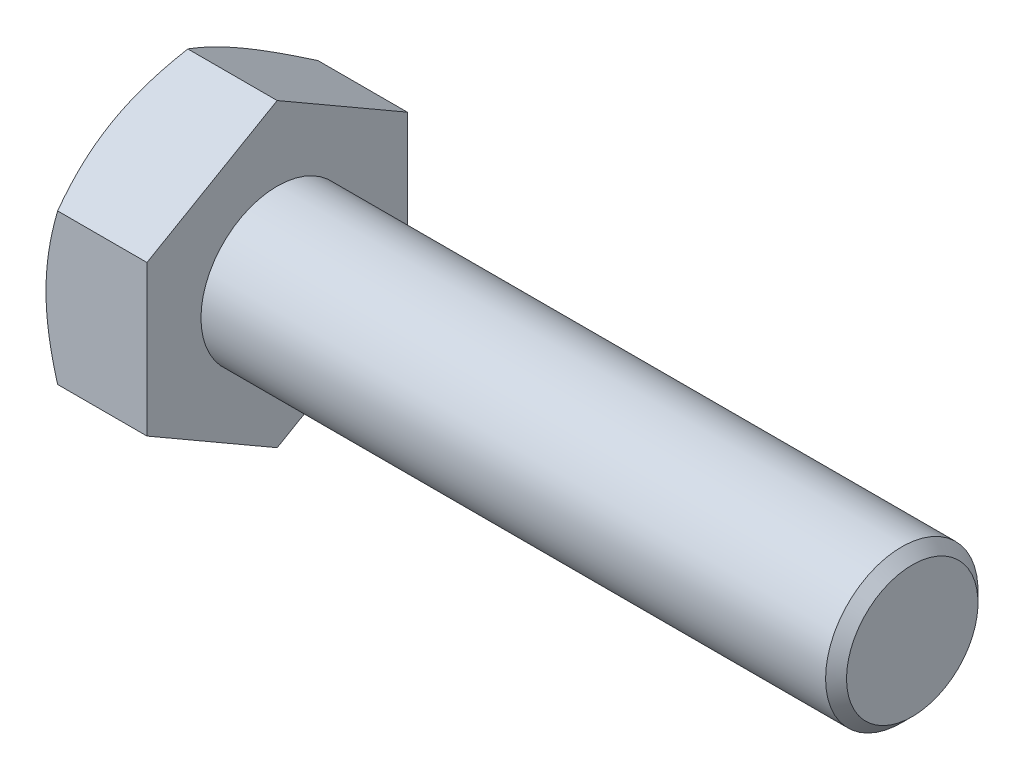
ISO-10303-21;
HEADER;
FILE_DESCRIPTION(('STEP AP214'),'2;1');
FILE_NAME('part.step','',(''),(''),'','','');
FILE_SCHEMA(('AUTOMOTIVE_DESIGN { 1 0 10303 214 1 1 1 1 }'));
ENDSEC;
DATA;
#1=APPLICATION_CONTEXT('core data for automotive mechanical design processes');
#2=APPLICATION_PROTOCOL_DEFINITION('international standard','automotive_design',2000,#1);
#3=PRODUCT_CONTEXT('',#1,'mechanical');
#4=PRODUCT('Part','Part','',(#3));
#5=PRODUCT_RELATED_PRODUCT_CATEGORY('part','',(#4));
#6=PRODUCT_DEFINITION_FORMATION('','',#4);
#7=PRODUCT_DEFINITION_CONTEXT('part definition',#1,'design');
#8=PRODUCT_DEFINITION('design','',#6,#7);
#9=PRODUCT_DEFINITION_SHAPE('','',#8);
#10=(LENGTH_UNIT() NAMED_UNIT(*) SI_UNIT(.MILLI.,.METRE.));
#11=(NAMED_UNIT(*) PLANE_ANGLE_UNIT() SI_UNIT($,.RADIAN.));
#12=(NAMED_UNIT(*) SI_UNIT($,.STERADIAN.) SOLID_ANGLE_UNIT());
#13=UNCERTAINTY_MEASURE_WITH_UNIT(LENGTH_MEASURE(1.E-05),#10,'distance_accuracy_value','');
#14=(GEOMETRIC_REPRESENTATION_CONTEXT(3) GLOBAL_UNCERTAINTY_ASSIGNED_CONTEXT((#13)) GLOBAL_UNIT_ASSIGNED_CONTEXT((#10,
#11,#12)) REPRESENTATION_CONTEXT('',''));
#15=CARTESIAN_POINT('',(0.,0.,0.));
#16=DIRECTION('',(0.,0.,1.));
#17=DIRECTION('',(1.,0.,0.));
#18=AXIS2_PLACEMENT_3D('',#15,#16,#17);
#19=CARTESIAN_POINT('',(15.9,11.8356805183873,-20.5));
#20=DIRECTION('',(0.,-0.866025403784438,0.500000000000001));
#21=DIRECTION('',(0.,-0.500000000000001,-0.866025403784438));
#22=AXIS2_PLACEMENT_3D('',#19,#20,#21);
#23=PLANE('',#22);
#24=CARTESIAN_POINT('',(1.83105281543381,23.6714765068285,0.000200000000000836));
#25=CARTESIAN_POINT('',(1.68086967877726,23.4113332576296,-0.45038132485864));
#26=CARTESIAN_POINT('',(1.53750164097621,23.1501753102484,-0.902720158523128));
#27=CARTESIAN_POINT('',(1.26629011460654,22.6257652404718,-1.81102504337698));
#28=CARTESIAN_POINT('',(1.13845173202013,22.3625124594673,-2.26699223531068));
#29=CARTESIAN_POINT('',(0.900017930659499,21.8334039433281,-3.1834350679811));
#30=CARTESIAN_POINT('',(0.789463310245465,21.5675435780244,-3.64391872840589));
#31=CARTESIAN_POINT('',(0.587971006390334,21.0339755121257,-4.56808572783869));
#32=CARTESIAN_POINT('',(0.497032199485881,20.7662679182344,-5.0317688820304));
#33=CARTESIAN_POINT('',(0.338639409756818,20.2358649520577,-5.95045376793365));
#34=CARTESIAN_POINT('',(0.270661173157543,19.9732089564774,-6.40538729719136));
#35=CARTESIAN_POINT('',(0.156677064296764,19.4466934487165,-7.3173389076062));
#36=CARTESIAN_POINT('',(0.110671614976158,19.1828339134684,-7.77435702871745));
#37=CARTESIAN_POINT('',(0.0417946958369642,18.6546716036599,-8.68916098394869));
#38=CARTESIAN_POINT('',(0.0188957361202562,18.3903697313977,-9.14694525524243));
#39=CARTESIAN_POINT('',(-0.0032757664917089,17.8615220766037,-10.0629362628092));
#40=CARTESIAN_POINT('',(-0.00254903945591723,17.5969763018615,-10.5211429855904));
#41=CARTESIAN_POINT('',(0.0208807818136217,17.1024027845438,-11.3777694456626));
#42=CARTESIAN_POINT('',(0.0407268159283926,16.8723398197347,-11.776250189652));
#43=CARTESIAN_POINT('',(0.0979103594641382,16.412763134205,-12.5722603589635));
#44=CARTESIAN_POINT('',(0.135247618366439,16.1832494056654,-12.9697897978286));
#45=CARTESIAN_POINT('',(0.226766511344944,15.7248559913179,-13.7637504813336));
#46=CARTESIAN_POINT('',(0.280963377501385,15.4959770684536,-14.1601804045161));
#47=CARTESIAN_POINT('',(0.40524228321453,15.0393151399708,-14.9511420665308));
#48=CARTESIAN_POINT('',(0.475324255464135,14.8115321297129,-15.3456738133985));
#49=CARTESIAN_POINT('',(0.711196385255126,14.120031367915,-16.5433882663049));
#50=CARTESIAN_POINT('',(0.900518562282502,13.658278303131,-17.3431680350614));
#51=CARTESIAN_POINT('',(1.22283076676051,12.9707481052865,-18.5340052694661));
#52=CARTESIAN_POINT('',(1.33654034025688,12.7426182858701,-18.9291377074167));
#53=CARTESIAN_POINT('',(1.57547119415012,12.2879365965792,-19.7166694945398));
#54=CARTESIAN_POINT('',(1.70068922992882,12.0613843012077,-20.1090695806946));
#55=CARTESIAN_POINT('',(1.83105281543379,11.8355650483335,-20.5002));
#56=B_SPLINE_CURVE_WITH_KNOTS('',3,(#24,#25,#26,#27,#28,#29,#30,#31,#32,#33,#34,#35,#36,#37,#38,
#39,#40,#41,#42,#43,#44,#45,#46,#47,#48,#49,#50,#51,#52,#53,#54,#55),.UNSPECIFIED.,.F.,.F.,(4,2,
2,2,2,2,2,2,2,2,2,2,2,2,2,4),(0.,1.62462772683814,3.24978817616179,4.87872871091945,
6.50757592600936,8.09621981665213,9.6848942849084,11.2716764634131,12.8584096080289,
14.2397371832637,15.6210449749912,17.0036043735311,18.3861579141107,21.2121645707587,
22.6227063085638,24.0328515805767),.UNSPECIFIED.);
#57=CARTESIAN_POINT('',(1.83098614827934,23.6713610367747,0.));
#58=VERTEX_POINT('',#57);
#59=CARTESIAN_POINT('',(0.,17.753520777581,-10.25));
#60=VERTEX_POINT('',#59);
#61=EDGE_CURVE('E49',#58,#60,#56,.T.);
#62=ORIENTED_EDGE('',*,*,#61,.F.);
#63=DIRECTION('',(-1.,0.,0.));
#64=VECTOR('',#63,1.);
#65=CARTESIAN_POINT('',(15.9,23.6713610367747,0.));
#66=LINE('',#65,#64);
#67=CARTESIAN_POINT('',(15.9,23.6713610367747,0.));
#68=VERTEX_POINT('',#67);
#69=EDGE_CURVE('E145',#68,#58,#66,.T.);
#70=ORIENTED_EDGE('',*,*,#69,.F.);
#71=DIRECTION('',(0.,0.500000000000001,0.866025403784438));
#72=VECTOR('',#71,1.);
#73=CARTESIAN_POINT('',(15.9,11.8356805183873,-20.5));
#74=LINE('',#73,#72);
#75=CARTESIAN_POINT('',(15.9,11.8356805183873,-20.5));
#76=VERTEX_POINT('',#75);
#77=EDGE_CURVE('E236',#76,#68,#74,.T.);
#78=ORIENTED_EDGE('',*,*,#77,.F.);
#79=DIRECTION('',(-1.,0.,0.));
#80=VECTOR('',#79,1.);
#81=CARTESIAN_POINT('',(15.9,11.8356805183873,-20.5));
#82=LINE('',#81,#80);
#83=CARTESIAN_POINT('',(1.83098614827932,11.8356805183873,-20.5));
#84=VERTEX_POINT('',#83);
#85=EDGE_CURVE('E133',#76,#84,#82,.T.);
#86=ORIENTED_EDGE('',*,*,#85,.T.);
#87=EDGE_CURVE('E127',#60,#84,#56,.T.);
#88=ORIENTED_EDGE('',*,*,#87,.F.);
#89=EDGE_LOOP('',(#62,#70,#78,#86,#88));
#90=FACE_BOUND('',#89,.T.);
#91=ADVANCED_FACE('F33',(#90),#23,.F.);
#92=CARTESIAN_POINT('',(15.9,23.6713610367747,0.));
#93=DIRECTION('',(0.,-0.866025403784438,-0.500000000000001));
#94=DIRECTION('',(0.,0.500000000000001,-0.866025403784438));
#95=AXIS2_PLACEMENT_3D('',#92,#93,#94);
#96=PLANE('',#95);
#97=CARTESIAN_POINT('',(1.83105281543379,11.8355650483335,20.5002));
#98=CARTESIAN_POINT('',(1.68086967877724,12.0957082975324,20.0496186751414));
#99=CARTESIAN_POINT('',(1.5375016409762,12.3568662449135,19.5972798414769));
#100=CARTESIAN_POINT('',(1.26629011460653,12.8812763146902,18.688974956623));
#101=CARTESIAN_POINT('',(1.13845173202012,13.1445290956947,18.2330077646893));
#102=CARTESIAN_POINT('',(0.900017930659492,13.6736376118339,17.3165649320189));
#103=CARTESIAN_POINT('',(0.789463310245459,13.9394979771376,16.8560812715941));
#104=CARTESIAN_POINT('',(0.587971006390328,14.4730660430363,15.9319142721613));
#105=CARTESIAN_POINT('',(0.497032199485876,14.7407736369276,15.4682311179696));
#106=CARTESIAN_POINT('',(0.338639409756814,15.2711766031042,14.5495462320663));
#107=CARTESIAN_POINT('',(0.270661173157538,15.5338325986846,14.0946127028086));
#108=CARTESIAN_POINT('',(0.156677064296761,16.0603481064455,13.1826610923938));
#109=CARTESIAN_POINT('',(0.110671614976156,16.3242076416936,12.7256429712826));
#110=CARTESIAN_POINT('',(0.0417946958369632,16.8523699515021,11.8108390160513));
#111=CARTESIAN_POINT('',(0.0188957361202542,17.1166718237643,11.3530547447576));
#112=CARTESIAN_POINT('',(-0.00327576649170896,17.6455194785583,10.4370637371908));
#113=CARTESIAN_POINT('',(-0.00254903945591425,17.9100652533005,9.97885701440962));
#114=CARTESIAN_POINT('',(0.0208807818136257,18.4046387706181,9.1222305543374));
#115=CARTESIAN_POINT('',(0.0407268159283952,18.6347017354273,8.72374981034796));
#116=CARTESIAN_POINT('',(0.0979103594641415,19.094278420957,7.92773964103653));
#117=CARTESIAN_POINT('',(0.135247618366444,19.3237921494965,7.5302102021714));
#118=CARTESIAN_POINT('',(0.22676651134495,19.7821855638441,6.73624951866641));
#119=CARTESIAN_POINT('',(0.280963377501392,20.0110644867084,6.33981959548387));
#120=CARTESIAN_POINT('',(0.405242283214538,20.4677264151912,5.54885793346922));
#121=CARTESIAN_POINT('',(0.475324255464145,20.6955094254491,5.15432618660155));
#122=CARTESIAN_POINT('',(0.711196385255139,21.387010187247,3.95661173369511));
#123=CARTESIAN_POINT('',(0.900518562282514,21.8487632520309,3.15683196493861));
#124=CARTESIAN_POINT('',(1.22283076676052,22.5362934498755,1.96599473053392));
#125=CARTESIAN_POINT('',(1.3365403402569,22.7644232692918,1.57086229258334));
#126=CARTESIAN_POINT('',(1.57547119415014,23.2191049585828,0.783330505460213));
#127=CARTESIAN_POINT('',(1.70068922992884,23.4456572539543,0.390930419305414));
#128=CARTESIAN_POINT('',(1.83105281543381,23.6714765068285,-0.000199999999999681));
#129=B_SPLINE_CURVE_WITH_KNOTS('',3,(#97,#98,#99,#100,#101,#102,#103,#104,#105,#106,#107,#108,
#109,#110,#111,#112,#113,#114,#115,#116,#117,#118,#119,#120,#121,#122,#123,#124,#125,#126,#127,
#128),.UNSPECIFIED.,.F.,.F.,(4,2,2,2,2,2,2,2,2,2,2,2,2,2,2,4),(0.,1.62462772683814,
3.24978817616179,4.87872871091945,6.50757592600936,8.09621981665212,9.68489428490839,
11.2716764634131,12.8584096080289,14.2397371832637,15.6210449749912,17.0036043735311,
18.3861579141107,21.2121645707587,22.6227063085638,24.0328515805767),.UNSPECIFIED.);
#130=CARTESIAN_POINT('',(1.83098614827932,11.8356805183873,20.5));
#131=VERTEX_POINT('',#130);
#132=CARTESIAN_POINT('',(0.,17.753520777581,10.25));
#133=VERTEX_POINT('',#132);
#134=EDGE_CURVE('E56',#131,#133,#129,.T.);
#135=ORIENTED_EDGE('',*,*,#134,.F.);
#136=DIRECTION('',(-1.,0.,0.));
#137=VECTOR('',#136,1.);
#138=CARTESIAN_POINT('',(15.9,11.8356805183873,20.5));
#139=LINE('',#138,#137);
#140=CARTESIAN_POINT('',(15.9,11.8356805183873,20.5));
#141=VERTEX_POINT('',#140);
#142=EDGE_CURVE('E143',#141,#131,#139,.T.);
#143=ORIENTED_EDGE('',*,*,#142,.F.);
#144=DIRECTION('',(0.,-0.500000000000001,0.866025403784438));
#145=VECTOR('',#144,1.);
#146=CARTESIAN_POINT('',(15.9,23.6713610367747,0.));
#147=LINE('',#146,#145);
#148=EDGE_CURVE('E234',#68,#141,#147,.T.);
#149=ORIENTED_EDGE('',*,*,#148,.F.);
#150=ORIENTED_EDGE('',*,*,#69,.T.);
#151=EDGE_CURVE('E160',#133,#58,#129,.T.);
#152=ORIENTED_EDGE('',*,*,#151,.F.);
#153=EDGE_LOOP('',(#135,#143,#149,#150,#152));
#154=FACE_BOUND('',#153,.T.);
#155=ADVANCED_FACE('F166',(#154),#96,.F.);
#156=CARTESIAN_POINT('',(15.9,11.8356805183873,20.5));
#157=DIRECTION('',(0.,0.,-1.));
#158=DIRECTION('',(-1.,0.,0.));
#159=AXIS2_PLACEMENT_3D('',#156,#157,#158);
#160=PLANE('',#159);
#161=CARTESIAN_POINT('',(10.0045735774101,-31.7921389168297,20.5));
#162=CARTESIAN_POINT('',(9.78736329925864,-31.3444790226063,20.5));
#163=CARTESIAN_POINT('',(9.57123614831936,-30.896293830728,20.5));
#164=CARTESIAN_POINT('',(9.14139340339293,-29.9987632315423,20.5));
#165=CARTESIAN_POINT('',(8.92767783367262,-29.5494178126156,20.5));
#166=CARTESIAN_POINT('',(8.29046013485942,-28.1993571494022,20.5));
#167=CARTESIAN_POINT('',(7.87095143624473,-27.2967499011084,20.5));
#168=CARTESIAN_POINT('',(7.04286118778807,-25.480583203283,20.5));
#169=CARTESIAN_POINT('',(6.63435156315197,-24.5669908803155,20.5));
#170=CARTESIAN_POINT('',(5.83404260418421,-22.7325410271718,20.5));
#171=CARTESIAN_POINT('',(5.44224248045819,-21.8116838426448,20.5));
#172=CARTESIAN_POINT('',(4.66751070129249,-19.9314771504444,20.5));
#173=CARTESIAN_POINT('',(4.28526901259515,-18.9718418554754,20.5));
#174=CARTESIAN_POINT('',(3.54971359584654,-17.0413372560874,20.5));
#175=CARTESIAN_POINT('',(3.19640311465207,-16.070466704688,20.5));
#176=CARTESIAN_POINT('',(2.52799067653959,-14.1177960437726,20.5));
#177=CARTESIAN_POINT('',(2.2128113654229,-13.1360226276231,20.5));
#178=CARTESIAN_POINT('',(1.63075735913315,-11.1582993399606,20.5));
#179=CARTESIAN_POINT('',(1.36386744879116,-10.1623540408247,20.5));
#180=CARTESIAN_POINT('',(1.01013936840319,-8.66039751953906,20.5));
#181=CARTESIAN_POINT('',(0.900235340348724,-8.15978559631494,20.5));
#182=CARTESIAN_POINT('',(0.697271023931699,-7.15514108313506,20.5));
#183=CARTESIAN_POINT('',(0.604210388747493,-6.65110856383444,20.5));
#184=CARTESIAN_POINT('',(0.436577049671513,-5.63997954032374,20.5));
#185=CARTESIAN_POINT('',(0.362003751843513,-5.13288313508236,20.5));
#186=CARTESIAN_POINT('',(0.23282804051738,-4.11613536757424,20.5));
#187=CARTESIAN_POINT('',(0.178225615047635,-3.60648400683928,20.5));
#188=CARTESIAN_POINT('',(0.090765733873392,-2.5920207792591,20.5));
#189=CARTESIAN_POINT('',(0.0576332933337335,-2.08723276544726,20.5));
#190=CARTESIAN_POINT('',(0.0127447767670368,-1.07670899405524,20.5));
#191=CARTESIAN_POINT('',(0.000988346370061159,-0.570973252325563,20.5));
#192=CARTESIAN_POINT('',(-0.000868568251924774,0.440543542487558,20.5));
#193=CARTESIAN_POINT('',(0.00903105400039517,0.946324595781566,20.5));
#194=CARTESIAN_POINT('',(0.0502449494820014,1.957018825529,20.5));
#195=CARTESIAN_POINT('',(0.0815601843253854,2.46193196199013,20.5));
#196=CARTESIAN_POINT('',(0.18189293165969,3.67541240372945,20.5));
#197=CARTESIAN_POINT('',(0.261072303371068,4.38315427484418,20.5));
#198=CARTESIAN_POINT('',(0.457195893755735,5.79338947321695,20.5));
#199=CARTESIAN_POINT('',(0.574145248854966,6.49588207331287,20.5));
#200=CARTESIAN_POINT('',(0.841648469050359,7.89494840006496,20.5));
#201=CARTESIAN_POINT('',(0.99222858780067,8.59151705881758,20.5));
#202=CARTESIAN_POINT('',(1.32239799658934,9.97766865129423,20.5));
#203=CARTESIAN_POINT('',(1.50198684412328,10.6672516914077,20.5));
#204=CARTESIAN_POINT('',(1.89003635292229,12.0545545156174,20.5));
#205=CARTESIAN_POINT('',(2.09904485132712,12.7521199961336,20.5));
#206=CARTESIAN_POINT('',(2.538641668,14.1403793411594,20.5));
#207=CARTESIAN_POINT('',(2.76923012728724,14.8310731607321,20.5));
#208=CARTESIAN_POINT('',(3.2483270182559,16.2059303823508,20.5));
#209=CARTESIAN_POINT('',(3.49682946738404,16.8900958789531,20.5));
#210=CARTESIAN_POINT('',(4.00883234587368,18.2527591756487,20.5));
#211=CARTESIAN_POINT('',(4.27233260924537,18.9312570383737,20.5));
#212=CARTESIAN_POINT('',(4.90504075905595,20.5167699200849,20.5));
#213=CARTESIAN_POINT('',(5.27932054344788,21.421757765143,20.5));
#214=CARTESIAN_POINT('',(6.04577825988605,23.224144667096,20.5));
#215=CARTESIAN_POINT('',(6.43795725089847,24.121543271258,20.5));
#216=CARTESIAN_POINT('',(7.23667478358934,25.9101426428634,20.5));
#217=CARTESIAN_POINT('',(7.64321640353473,26.8013420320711,20.5));
#218=CARTESIAN_POINT('',(8.46779917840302,28.5783696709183,20.5));
#219=CARTESIAN_POINT('',(8.88584009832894,29.4641980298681,20.5));
#220=CARTESIAN_POINT('',(9.73174717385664,31.232304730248,20.5));
#221=CARTESIAN_POINT('',(10.1596233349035,32.1145782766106,20.5));
#222=CARTESIAN_POINT('',(11.023106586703,33.8753332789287,20.5));
#223=CARTESIAN_POINT('',(11.458713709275,34.753814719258,20.5));
#224=CARTESIAN_POINT('',(12.336294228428,36.5074549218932,20.5));
#225=CARTESIAN_POINT('',(12.7782668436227,37.3826140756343,20.5));
#226=CARTESIAN_POINT('',(13.6675972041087,39.1301871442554,20.5));
#227=CARTESIAN_POINT('',(14.1149549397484,40.002601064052,20.5));
#228=CARTESIAN_POINT('',(15.3896420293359,42.4725798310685,20.5));
#229=CARTESIAN_POINT('',(16.2223378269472,44.0673751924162,20.5));
#230=CARTESIAN_POINT('',(17.8991647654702,47.250997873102,20.5));
#231=CARTESIAN_POINT('',(18.7432962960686,48.8398249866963,20.5));
#232=CARTESIAN_POINT('',(20.4382614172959,52.0089141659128,20.5));
#233=CARTESIAN_POINT('',(21.2890736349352,53.589187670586,20.5));
#234=CARTESIAN_POINT('',(22.5704014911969,55.9567745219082,20.5));
#235=CARTESIAN_POINT('',(22.9983509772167,56.7454787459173,20.5));
#236=CARTESIAN_POINT('',(23.8557834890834,58.3220516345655,20.5));
#237=CARTESIAN_POINT('',(24.2852665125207,59.1099203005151,20.5));
#238=CARTESIAN_POINT('',(24.7154284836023,59.8974182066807,20.5));
#239=B_SPLINE_CURVE_WITH_KNOTS('',3,(#161,#162,#163,#164,#165,#166,#167,#168,#169,#170,#171,
#172,#173,#174,#175,#176,#177,#178,#179,#180,#181,#182,#183,#184,#185,#186,#187,#188,#189,#190,
#191,#192,#193,#194,#195,#196,#197,#198,#199,#200,#201,#202,#203,#204,#205,#206,#207,#208,#209,
#210,#211,#212,#213,#214,#215,#216,#217,#218,#219,#220,#221,#222,#223,#224,#225,#226,#227,#228,
#229,#230,#231,#232,#233,#234,#235,#236,#237,#238),.UNSPECIFIED.,.F.,.F.,(4,2,2,2,2,2,2,2,2,2,2,
2,2,2,2,2,2,2,2,2,2,2,2,2,2,2,2,2,2,2,2,2,2,2,2,2,2,2,4),(0.,1.49271869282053,2.9854523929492,
5.97136149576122,8.97352680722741,11.9755501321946,15.0740772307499,18.1729515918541,
21.2654301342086,24.3569325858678,25.8942973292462,27.4316304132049,28.9689141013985,
30.5061968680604,32.0233793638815,33.5405367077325,35.0577015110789,36.5749344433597,
38.7102245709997,40.8458052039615,42.9830588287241,45.1202798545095,47.3044767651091,
49.4886879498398,51.6721730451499,53.8556339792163,56.7933660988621,59.7312722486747,
62.6698119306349,65.6082916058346,68.5499059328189,71.4915323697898,74.4328007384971,
77.3740638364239,82.771288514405,88.168697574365,93.5529397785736,96.2449184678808,
98.9368929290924),.UNSPECIFIED.);
#240=CARTESIAN_POINT('',(1.83098614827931,-11.8356805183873,20.5));
#241=VERTEX_POINT('',#240);
#242=CARTESIAN_POINT('',(0.,0.,20.5));
#243=VERTEX_POINT('',#242);
#244=EDGE_CURVE('E246',#241,#243,#239,.T.);
#245=ORIENTED_EDGE('',*,*,#244,.F.);
#246=DIRECTION('',(-1.,0.,0.));
#247=VECTOR('',#246,1.);
#248=CARTESIAN_POINT('',(15.9,-11.8356805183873,20.5));
#249=LINE('',#248,#247);
#250=CARTESIAN_POINT('',(15.9,-11.8356805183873,20.5));
#251=VERTEX_POINT('',#250);
#252=EDGE_CURVE('E135',#251,#241,#249,.T.);
#253=ORIENTED_EDGE('',*,*,#252,.F.);
#254=DIRECTION('',(0.,-1.,0.));
#255=VECTOR('',#254,1.);
#256=CARTESIAN_POINT('',(15.9,11.8356805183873,20.5));
#257=LINE('',#256,#255);
#258=EDGE_CURVE('E230',#141,#251,#257,.T.);
#259=ORIENTED_EDGE('',*,*,#258,.F.);
#260=ORIENTED_EDGE('',*,*,#142,.T.);
#261=EDGE_CURVE('E184',#243,#131,#239,.T.);
#262=ORIENTED_EDGE('',*,*,#261,.F.);
#263=EDGE_LOOP('',(#245,#253,#259,#260,#262));
#264=FACE_BOUND('',#263,.T.);
#265=ADVANCED_FACE('F252',(#264),#160,.F.);
#266=CARTESIAN_POINT('',(15.9,-23.6713610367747,0.));
#267=DIRECTION('',(0.,0.866025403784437,-0.500000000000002));
#268=DIRECTION('',(0.,0.500000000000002,0.866025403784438));
#269=AXIS2_PLACEMENT_3D('',#266,#267,#268);
#270=PLANE('',#269);
#271=CARTESIAN_POINT('',(1.8310528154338,-23.6714765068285,-0.000200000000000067));
#272=CARTESIAN_POINT('',(1.68086967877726,-23.4113332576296,0.450381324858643));
#273=CARTESIAN_POINT('',(1.53750164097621,-23.1501753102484,0.90272015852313));
#274=CARTESIAN_POINT('',(1.26629011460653,-22.6257652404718,1.81102504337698));
#275=CARTESIAN_POINT('',(1.13845173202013,-22.3625124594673,2.26699223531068));
#276=CARTESIAN_POINT('',(0.900017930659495,-21.8334039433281,3.1834350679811));
#277=CARTESIAN_POINT('',(0.789463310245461,-21.5675435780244,3.64391872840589));
#278=CARTESIAN_POINT('',(0.587971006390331,-21.0339755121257,4.56808572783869));
#279=CARTESIAN_POINT('',(0.497032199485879,-20.7662679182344,5.0317688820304));
#280=CARTESIAN_POINT('',(0.338639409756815,-20.2358649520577,5.95045376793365));
#281=CARTESIAN_POINT('',(0.270661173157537,-19.9732089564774,6.40538729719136));
#282=CARTESIAN_POINT('',(0.156677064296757,-19.4466934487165,7.31733890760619));
#283=CARTESIAN_POINT('',(0.110671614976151,-19.1828339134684,7.77435702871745));
#284=CARTESIAN_POINT('',(0.0417946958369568,-18.6546716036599,8.68916098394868));
#285=CARTESIAN_POINT('',(0.0188957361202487,-18.3903697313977,9.14694525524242));
#286=CARTESIAN_POINT('',(-0.00327576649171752,-17.8615220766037,10.0629362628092));
#287=CARTESIAN_POINT('',(-0.00254903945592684,-17.5969763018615,10.5211429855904));
#288=CARTESIAN_POINT('',(0.0208807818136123,-17.1024027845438,11.3777694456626));
#289=CARTESIAN_POINT('',(0.0407268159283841,-16.8723398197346,11.776250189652));
#290=CARTESIAN_POINT('',(0.0979103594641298,-16.412763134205,12.5722603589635));
#291=CARTESIAN_POINT('',(0.135247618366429,-16.1832494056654,12.9697897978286));
#292=CARTESIAN_POINT('',(0.226766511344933,-15.7248559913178,13.7637504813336));
#293=CARTESIAN_POINT('',(0.280963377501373,-15.4959770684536,14.1601804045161));
#294=CARTESIAN_POINT('',(0.405242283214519,-15.0393151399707,14.9511420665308));
#295=CARTESIAN_POINT('',(0.475324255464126,-14.8115321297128,15.3456738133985));
#296=CARTESIAN_POINT('',(0.711196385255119,-14.120031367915,16.5433882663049));
#297=CARTESIAN_POINT('',(0.900518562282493,-13.658278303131,17.3431680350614));
#298=CARTESIAN_POINT('',(1.2228307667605,-12.9707481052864,18.5340052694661));
#299=CARTESIAN_POINT('',(1.33654034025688,-12.7426182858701,18.9291377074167));
#300=CARTESIAN_POINT('',(1.57547119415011,-12.2879365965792,19.7166694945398));
#301=CARTESIAN_POINT('',(1.70068922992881,-12.0613843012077,20.1090695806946));
#302=CARTESIAN_POINT('',(1.83105281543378,-11.8355650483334,20.5002));
#303=B_SPLINE_CURVE_WITH_KNOTS('',3,(#271,#272,#273,#274,#275,#276,#277,#278,#279,#280,#281,
#282,#283,#284,#285,#286,#287,#288,#289,#290,#291,#292,#293,#294,#295,#296,#297,#298,#299,#300,
#301,#302),.UNSPECIFIED.,.F.,.F.,(4,2,2,2,2,2,2,2,2,2,2,2,2,2,2,4),(0.,1.62462772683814,
3.24978817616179,4.87872871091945,6.50757592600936,8.09621981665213,9.6848942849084,
11.2716764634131,12.8584096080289,14.2397371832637,15.6210449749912,17.0036043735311,
18.3861579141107,21.2121645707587,22.6227063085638,24.0328515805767),.UNSPECIFIED.);
#304=CARTESIAN_POINT('',(1.83098614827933,-23.6713610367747,0.));
#305=VERTEX_POINT('',#304);
#306=CARTESIAN_POINT('',(0.,-17.753520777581,10.25));
#307=VERTEX_POINT('',#306);
#308=EDGE_CURVE('E168',#305,#307,#303,.T.);
#309=ORIENTED_EDGE('',*,*,#308,.F.);
#310=DIRECTION('',(-1.,0.,0.));
#311=VECTOR('',#310,1.);
#312=CARTESIAN_POINT('',(15.9,-23.6713610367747,0.));
#313=LINE('',#312,#311);
#314=CARTESIAN_POINT('',(15.9,-23.6713610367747,0.));
#315=VERTEX_POINT('',#314);
#316=EDGE_CURVE('E132',#315,#305,#313,.T.);
#317=ORIENTED_EDGE('',*,*,#316,.F.);
#318=DIRECTION('',(0.,-0.500000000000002,-0.866025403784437));
#319=VECTOR('',#318,1.);
#320=CARTESIAN_POINT('',(15.9,-23.6713610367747,0.));
#321=LINE('',#320,#319);
#322=EDGE_CURVE('E228',#251,#315,#321,.T.);
#323=ORIENTED_EDGE('',*,*,#322,.F.);
#324=ORIENTED_EDGE('',*,*,#252,.T.);
#325=EDGE_CURVE('E170',#307,#241,#303,.T.);
#326=ORIENTED_EDGE('',*,*,#325,.F.);
#327=EDGE_LOOP('',(#309,#317,#323,#324,#326));
#328=FACE_BOUND('',#327,.T.);
#329=ADVANCED_FACE('F224',(#328),#270,.F.);
#330=CARTESIAN_POINT('',(15.9,-11.8356805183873,-20.5));
#331=DIRECTION('',(0.,0.866025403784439,0.5));
#332=DIRECTION('',(0.,-0.5,0.866025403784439));
#333=AXIS2_PLACEMENT_3D('',#330,#331,#332);
#334=PLANE('',#333);
#335=CARTESIAN_POINT('',(1.83105281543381,-11.8355650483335,-20.5002));
#336=CARTESIAN_POINT('',(1.68086967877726,-12.0957082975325,-20.0496186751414));
#337=CARTESIAN_POINT('',(1.53750164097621,-12.3568662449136,-19.5972798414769));
#338=CARTESIAN_POINT('',(1.26629011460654,-12.8812763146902,-18.688974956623));
#339=CARTESIAN_POINT('',(1.13845173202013,-13.1445290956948,-18.2330077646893));
#340=CARTESIAN_POINT('',(0.900017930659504,-13.6736376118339,-17.3165649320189));
#341=CARTESIAN_POINT('',(0.789463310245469,-13.9394979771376,-16.8560812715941));
#342=CARTESIAN_POINT('',(0.587971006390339,-14.4730660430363,-15.9319142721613));
#343=CARTESIAN_POINT('',(0.497032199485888,-14.7407736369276,-15.4682311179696));
#344=CARTESIAN_POINT('',(0.338639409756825,-15.2711766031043,-14.5495462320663));
#345=CARTESIAN_POINT('',(0.270661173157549,-15.5338325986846,-14.0946127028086));
#346=CARTESIAN_POINT('',(0.15667706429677,-16.0603481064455,-13.1826610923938));
#347=CARTESIAN_POINT('',(0.110671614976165,-16.3242076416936,-12.7256429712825));
#348=CARTESIAN_POINT('',(0.0417946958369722,-16.8523699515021,-11.8108390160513));
#349=CARTESIAN_POINT('',(0.0188957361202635,-17.1166718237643,-11.3530547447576));
#350=CARTESIAN_POINT('',(-0.00327576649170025,-17.6455194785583,-10.4370637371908));
#351=CARTESIAN_POINT('',(-0.00254903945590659,-17.9100652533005,-9.97885701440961));
#352=CARTESIAN_POINT('',(0.020880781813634,-18.4046387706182,-9.12223055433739));
#353=CARTESIAN_POINT('',(0.0407268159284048,-18.6347017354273,-8.72374981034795));
#354=CARTESIAN_POINT('',(0.09791035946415,-19.094278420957,-7.92773964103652));
#355=CARTESIAN_POINT('',(0.13524761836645,-19.3237921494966,-7.53021020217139));
#356=CARTESIAN_POINT('',(0.226766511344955,-19.7821855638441,-6.7362495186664));
#357=CARTESIAN_POINT('',(0.280963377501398,-20.0110644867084,-6.33981959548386));
#358=CARTESIAN_POINT('',(0.405242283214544,-20.4677264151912,-5.54885793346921));
#359=CARTESIAN_POINT('',(0.47532425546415,-20.6955094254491,-5.15432618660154));
#360=CARTESIAN_POINT('',(0.711196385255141,-21.387010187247,-3.95661173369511));
#361=CARTESIAN_POINT('',(0.900518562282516,-21.8487632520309,-3.1568319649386));
#362=CARTESIAN_POINT('',(1.22283076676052,-22.5362934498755,-1.96599473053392));
#363=CARTESIAN_POINT('',(1.3365403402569,-22.7644232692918,-1.57086229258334));
#364=CARTESIAN_POINT('',(1.57547119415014,-23.2191049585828,-0.783330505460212));
#365=CARTESIAN_POINT('',(1.70068922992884,-23.4456572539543,-0.390930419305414));
#366=CARTESIAN_POINT('',(1.8310528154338,-23.6714765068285,0.000200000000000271));
#367=B_SPLINE_CURVE_WITH_KNOTS('',3,(#335,#336,#337,#338,#339,#340,#341,#342,#343,#344,#345,
#346,#347,#348,#349,#350,#351,#352,#353,#354,#355,#356,#357,#358,#359,#360,#361,#362,#363,#364,
#365,#366),.UNSPECIFIED.,.F.,.F.,(4,2,2,2,2,2,2,2,2,2,2,2,2,2,2,4),(0.,1.62462772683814,
3.2497881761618,4.87872871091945,6.50757592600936,8.09621981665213,9.6848942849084,
11.2716764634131,12.8584096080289,14.2397371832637,15.6210449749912,17.0036043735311,
18.3861579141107,21.2121645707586,22.6227063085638,24.0328515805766),.UNSPECIFIED.);
#368=CARTESIAN_POINT('',(1.83098614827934,-11.8356805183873,-20.5));
#369=VERTEX_POINT('',#368);
#370=CARTESIAN_POINT('',(0.,-17.753520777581,-10.25));
#371=VERTEX_POINT('',#370);
#372=EDGE_CURVE('E109',#369,#371,#367,.T.);
#373=ORIENTED_EDGE('',*,*,#372,.F.);
#374=DIRECTION('',(-1.,0.,0.));
#375=VECTOR('',#374,1.);
#376=CARTESIAN_POINT('',(15.9,-11.8356805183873,-20.5));
#377=LINE('',#376,#375);
#378=CARTESIAN_POINT('',(15.9,-11.8356805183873,-20.5));
#379=VERTEX_POINT('',#378);
#380=EDGE_CURVE('E123',#379,#369,#377,.T.);
#381=ORIENTED_EDGE('',*,*,#380,.F.);
#382=DIRECTION('',(0.,0.5,-0.866025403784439));
#383=VECTOR('',#382,1.);
#384=CARTESIAN_POINT('',(15.9,-11.8356805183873,-20.5));
#385=LINE('',#384,#383);
#386=EDGE_CURVE('E226',#315,#379,#385,.T.);
#387=ORIENTED_EDGE('',*,*,#386,.F.);
#388=ORIENTED_EDGE('',*,*,#316,.T.);
#389=EDGE_CURVE('E126',#371,#305,#367,.T.);
#390=ORIENTED_EDGE('',*,*,#389,.F.);
#391=EDGE_LOOP('',(#373,#381,#387,#388,#390));
#392=FACE_BOUND('',#391,.T.);
#393=ADVANCED_FACE('F121',(#392),#334,.F.);
#394=CARTESIAN_POINT('',(15.9,11.8356805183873,-20.5));
#395=DIRECTION('',(0.,0.,1.));
#396=DIRECTION('',(0.,-1.,0.));
#397=AXIS2_PLACEMENT_3D('',#394,#395,#396);
#398=PLANE('',#397);
#399=CARTESIAN_POINT('',(10.0045735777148,-31.7921389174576,-20.5));
#400=CARTESIAN_POINT('',(9.78736329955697,-31.3444790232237,-20.5));
#401=CARTESIAN_POINT('',(9.57123614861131,-30.8962938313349,-20.5));
#402=CARTESIAN_POINT('',(9.14139340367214,-29.998763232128,-20.5));
#403=CARTESIAN_POINT('',(8.92767783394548,-29.5494178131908,-20.5));
#404=CARTESIAN_POINT('',(8.29046013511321,-28.1993571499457,-20.5));
#405=CARTESIAN_POINT('',(7.87095143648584,-27.2967499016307,-20.5));
#406=CARTESIAN_POINT('',(7.04286118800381,-25.4805832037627,-20.5));
#407=CARTESIAN_POINT('',(6.63435156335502,-24.5669908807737,-20.5));
#408=CARTESIAN_POINT('',(5.83404260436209,-22.7325410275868,-20.5));
#409=CARTESIAN_POINT('',(5.44224248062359,-21.8116838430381,-20.5));
#410=CARTESIAN_POINT('',(4.66751070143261,-19.9314771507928,-20.5));
#411=CARTESIAN_POINT('',(4.28526901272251,-18.9718418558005,-20.5));
#412=CARTESIAN_POINT('',(3.54971359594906,-17.0413372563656,-20.5));
#413=CARTESIAN_POINT('',(3.19640311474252,-16.0704667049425,-20.5));
#414=CARTESIAN_POINT('',(2.52799067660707,-14.1177960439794,-20.5));
#415=CARTESIAN_POINT('',(2.21281136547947,-13.1360226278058,-20.5));
#416=CARTESIAN_POINT('',(1.63075735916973,-11.1582993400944,-20.5));
#417=CARTESIAN_POINT('',(1.36386744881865,-10.1623540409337,-20.5));
#418=CARTESIAN_POINT('',(1.01013936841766,-8.66039751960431,-20.5));
#419=CARTESIAN_POINT('',(0.900235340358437,-8.15978559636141,-20.5));
#420=CARTESIAN_POINT('',(0.69727102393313,-7.15514108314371,-20.5));
#421=CARTESIAN_POINT('',(0.604210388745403,-6.65110856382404,-20.5));
#422=CARTESIAN_POINT('',(0.436577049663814,-5.63997954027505,-20.5));
#423=CARTESIAN_POINT('',(0.362003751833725,-5.13288313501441,-20.5));
#424=CARTESIAN_POINT('',(0.232828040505,-4.11613536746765,-20.5));
#425=CARTESIAN_POINT('',(0.178225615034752,-3.60648400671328,-20.5));
#426=CARTESIAN_POINT('',(0.090765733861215,-2.5920207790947,-20.5));
#427=CARTESIAN_POINT('',(0.0576332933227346,-2.08723276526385,-20.5));
#428=CARTESIAN_POINT('',(0.0127447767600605,-1.07670899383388,-20.5));
#429=CARTESIAN_POINT('',(0.000988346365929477,-0.570973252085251,-20.5));
#430=CARTESIAN_POINT('',(-0.000868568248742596,0.440543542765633,-20.5));
#431=CARTESIAN_POINT('',(0.00903105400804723,0.94632459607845,-20.5));
#432=CARTESIAN_POINT('',(0.0502449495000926,1.95701882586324,-20.5));
#433=CARTESIAN_POINT('',(0.0815601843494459,2.46193196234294,-20.5));
#434=CARTESIAN_POINT('',(0.181892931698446,3.67541240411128,-20.5));
#435=CARTESIAN_POINT('',(0.261072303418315,4.38315427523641,-20.5));
#436=CARTESIAN_POINT('',(0.45719589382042,5.79338947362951,-20.5));
#437=CARTESIAN_POINT('',(0.574145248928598,6.49588207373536,-20.5));
#438=CARTESIAN_POINT('',(0.84164846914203,7.89494840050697,-20.5));
#439=CARTESIAN_POINT('',(0.992228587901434,8.59151705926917,-20.5));
#440=CARTESIAN_POINT('',(1.32239799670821,9.97766865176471,-20.5));
#441=CARTESIAN_POINT('',(1.50198684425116,10.6672516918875,-20.5));
#442=CARTESIAN_POINT('',(1.89003635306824,12.0545545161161,-20.5));
#443=CARTESIAN_POINT('',(2.09904485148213,12.7521199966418,-20.5));
#444=CARTESIAN_POINT('',(2.53864166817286,14.1403793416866,-20.5));
#445=CARTESIAN_POINT('',(2.76923012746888,14.8310731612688,-20.5));
#446=CARTESIAN_POINT('',(3.24832701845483,16.2059303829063,-20.5));
#447=CARTESIAN_POINT('',(3.49682946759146,16.890095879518,-20.5));
#448=CARTESIAN_POINT('',(4.0088323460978,18.2527591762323,-20.5));
#449=CARTESIAN_POINT('',(4.27233260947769,18.9312570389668,-20.5));
#450=CARTESIAN_POINT('',(4.90504075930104,20.5167699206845,-20.5));
#451=CARTESIAN_POINT('',(5.27932054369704,21.4217577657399,-20.5));
#452=CARTESIAN_POINT('',(6.04577826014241,23.2241446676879,-20.5));
#453=CARTESIAN_POINT('',(6.43795725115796,24.1215432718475,-20.5));
#454=CARTESIAN_POINT('',(7.23667478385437,25.9101426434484,-20.5));
#455=CARTESIAN_POINT('',(7.64321640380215,26.801342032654,-20.5));
#456=CARTESIAN_POINT('',(8.4677991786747,28.5783696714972,-20.5));
#457=CARTESIAN_POINT('',(8.88584009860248,29.4641980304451,-20.5));
#458=CARTESIAN_POINT('',(9.73174717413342,31.2323047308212,-20.5));
#459=CARTESIAN_POINT('',(10.1596233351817,32.1145782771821,-20.5));
#460=CARTESIAN_POINT('',(11.0231065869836,33.8753332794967,-20.5));
#461=CARTESIAN_POINT('',(11.4587137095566,34.7538147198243,-20.5));
#462=CARTESIAN_POINT('',(12.3362942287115,36.5074549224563,-20.5));
#463=CARTESIAN_POINT('',(12.778266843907,37.3826140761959,-20.5));
#464=CARTESIAN_POINT('',(13.6675972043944,39.130187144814,-20.5));
#465=CARTESIAN_POINT('',(14.1149549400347,40.0026010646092,-20.5));
#466=CARTESIAN_POINT('',(15.3896420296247,42.4725798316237,-20.5));
#467=CARTESIAN_POINT('',(16.2223378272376,44.0673751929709,-20.5));
#468=CARTESIAN_POINT('',(17.8991647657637,47.2509978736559,-20.5));
#469=CARTESIAN_POINT('',(18.7432962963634,48.83982498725,-20.5));
#470=CARTESIAN_POINT('',(20.4382614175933,52.0089141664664,-20.5));
#471=CARTESIAN_POINT('',(21.2890736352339,53.5891876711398,-20.5));
#472=CARTESIAN_POINT('',(22.5704014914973,55.9567745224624,-20.5));
#473=CARTESIAN_POINT('',(22.9983509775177,56.7454787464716,-20.5));
#474=CARTESIAN_POINT('',(23.8557834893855,58.3220516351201,-20.5));
#475=CARTESIAN_POINT('',(24.2852665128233,59.1099203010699,-20.5));
#476=CARTESIAN_POINT('',(24.7154284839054,59.8974182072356,-20.5));
#477=B_SPLINE_CURVE_WITH_KNOTS('',3,(#399,#400,#401,#402,#403,#404,#405,#406,#407,#408,#409,
#410,#411,#412,#413,#414,#415,#416,#417,#418,#419,#420,#421,#422,#423,#424,#425,#426,#427,#428,
#429,#430,#431,#432,#433,#434,#435,#436,#437,#438,#439,#440,#441,#442,#443,#444,#445,#446,#447,
#448,#449,#450,#451,#452,#453,#454,#455,#456,#457,#458,#459,#460,#461,#462,#463,#464,#465,#466,
#467,#468,#469,#470,#471,#472,#473,#474,#475,#476),.UNSPECIFIED.,.F.,.F.,(4,2,2,2,2,2,2,2,2,2,2,
2,2,2,2,2,2,2,2,2,2,2,2,2,2,2,2,2,2,2,2,2,2,2,2,2,2,2,4),(0.,1.49271869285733,2.98545239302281,
5.97136149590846,8.97352680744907,11.9755501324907,15.0740772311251,18.1729515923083,
21.2654301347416,24.3569325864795,25.894297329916,27.4316304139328,28.9689141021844,
30.5061968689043,32.0233793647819,33.5405367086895,35.0577015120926,36.57493444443,
38.7102245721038,40.8458052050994,42.9830588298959,45.1202798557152,47.3044767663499,
49.4886879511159,51.6721730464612,53.8556339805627,56.7933661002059,59.7312722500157,
62.6698119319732,65.6082916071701,68.5499059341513,71.4915323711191,74.4328007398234,
77.3740638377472,82.7712885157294,88.1686975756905,93.5529397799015,96.2449184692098,
98.9368929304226),.UNSPECIFIED.);
#478=CARTESIAN_POINT('',(0.,0.,-20.5));
#479=VERTEX_POINT('',#478);
#480=EDGE_CURVE('E115',#84,#479,#477,.F.);
#481=ORIENTED_EDGE('',*,*,#480,.F.);
#482=ORIENTED_EDGE('',*,*,#85,.F.);
#483=DIRECTION('',(0.,1.,0.));
#484=VECTOR('',#483,1.);
#485=CARTESIAN_POINT('',(15.9,11.8356805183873,-20.5));
#486=LINE('',#485,#484);
#487=EDGE_CURVE('E131',#379,#76,#486,.T.);
#488=ORIENTED_EDGE('',*,*,#487,.F.);
#489=ORIENTED_EDGE('',*,*,#380,.T.);
#490=EDGE_CURVE('E106',#479,#369,#477,.F.);
#491=ORIENTED_EDGE('',*,*,#490,.F.);
#492=EDGE_LOOP('',(#481,#482,#488,#489,#491));
#493=FACE_BOUND('',#492,.T.);
#494=ADVANCED_FACE('F129',(#493),#398,.F.);
#495=CARTESIAN_POINT('',(15.9,23.6713610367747,0.));
#496=DIRECTION('',(1.,0.,0.));
#497=DIRECTION('',(0.,0.,-1.));
#498=AXIS2_PLACEMENT_3D('',#495,#496,#497);
#499=PLANE('',#498);
#500=CARTESIAN_POINT('',(15.9,0.,0.));
#501=DIRECTION('',(1.,0.,0.));
#502=DIRECTION('',(0.,0.,-1.));
#503=AXIS2_PLACEMENT_3D('',#500,#501,#502);
#504=CIRCLE('',#503,12.);
#505=CARTESIAN_POINT('',(15.9,0.,-12.));
#506=VERTEX_POINT('',#505);
#507=EDGE_CURVE('E239',#506,#506,#504,.F.);
#508=ORIENTED_EDGE('',*,*,#507,.T.);
#509=EDGE_LOOP('',(#508));
#510=FACE_BOUND('',#509,.T.);
#511=ORIENTED_EDGE('',*,*,#77,.T.);
#512=ORIENTED_EDGE('',*,*,#148,.T.);
#513=ORIENTED_EDGE('',*,*,#258,.T.);
#514=ORIENTED_EDGE('',*,*,#322,.T.);
#515=ORIENTED_EDGE('',*,*,#386,.T.);
#516=ORIENTED_EDGE('',*,*,#487,.T.);
#517=EDGE_LOOP('',(#511,#512,#513,#514,#515,#516));
#518=FACE_BOUND('',#517,.T.);
#519=ADVANCED_FACE('F254',(#510,#518),#499,.T.);
#520=CARTESIAN_POINT('',(0.,0.,0.));
#521=DIRECTION('',(-1.,0.,0.));
#522=DIRECTION('',(0.,0.,1.));
#523=AXIS2_PLACEMENT_3D('',#520,#521,#522);
#524=CYLINDRICAL_SURFACE('',#523,12.);
#525=ORIENTED_EDGE('',*,*,#507,.F.);
#526=EDGE_LOOP('',(#525));
#527=FACE_BOUND('',#526,.T.);
#528=CARTESIAN_POINT('',(114.252,0.,0.));
#529=DIRECTION('',(-1.,0.,0.));
#530=DIRECTION('',(0.,0.,1.));
#531=AXIS2_PLACEMENT_3D('',#528,#529,#530);
#532=CIRCLE('',#531,12.);
#533=CARTESIAN_POINT('',(114.252,0.,12.));
#534=VERTEX_POINT('',#533);
#535=EDGE_CURVE('E242',#534,#534,#532,.T.);
#536=ORIENTED_EDGE('',*,*,#535,.T.);
#537=EDGE_LOOP('',(#536));
#538=FACE_BOUND('',#537,.T.);
#539=ADVANCED_FACE('F285',(#527,#538),#524,.T.);
#540=CARTESIAN_POINT('',(115.9,0.,0.));
#541=DIRECTION('',(-1.,0.,0.));
#542=DIRECTION('',(0.,0.,1.));
#543=AXIS2_PLACEMENT_3D('',#540,#541,#542);
#544=CONICAL_SURFACE('',#543,10.352,0.785398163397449);
#545=ORIENTED_EDGE('',*,*,#535,.F.);
#546=EDGE_LOOP('',(#545));
#547=FACE_BOUND('',#546,.T.);
#548=CARTESIAN_POINT('',(115.9,0.,0.));
#549=DIRECTION('',(-1.,0.,0.));
#550=DIRECTION('',(0.,0.,1.));
#551=AXIS2_PLACEMENT_3D('',#548,#549,#550);
#552=CIRCLE('',#551,10.352);
#553=CARTESIAN_POINT('',(115.9,0.,10.352));
#554=VERTEX_POINT('',#553);
#555=EDGE_CURVE('E244',#554,#554,#552,.T.);
#556=ORIENTED_EDGE('',*,*,#555,.T.);
#557=EDGE_LOOP('',(#556));
#558=FACE_BOUND('',#557,.T.);
#559=ADVANCED_FACE('F288',(#547,#558),#544,.T.);
#560=CARTESIAN_POINT('',(115.9,0.,0.));
#561=DIRECTION('',(-1.,0.,0.));
#562=DIRECTION('',(0.,0.,1.));
#563=AXIS2_PLACEMENT_3D('',#560,#561,#562);
#564=PLANE('',#563);
#565=ORIENTED_EDGE('',*,*,#555,.F.);
#566=EDGE_LOOP('',(#565));
#567=FACE_BOUND('',#566,.T.);
#568=ADVANCED_FACE('F198',(#567),#564,.F.);
#569=CARTESIAN_POINT('',(0.,0.,0.));
#570=DIRECTION('',(1.,0.,0.));
#571=DIRECTION('',(0.,0.,-1.));
#572=AXIS2_PLACEMENT_3D('',#569,#570,#571);
#573=CONICAL_SURFACE('',#572,20.5,1.0471975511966);
#574=ORIENTED_EDGE('',*,*,#372,.T.);
#575=CARTESIAN_POINT('',(0.,0.,0.));
#576=DIRECTION('',(1.,0.,0.));
#577=DIRECTION('',(0.,0.,-1.));
#578=AXIS2_PLACEMENT_3D('',#575,#576,#577);
#579=CIRCLE('',#578,20.5);
#580=EDGE_CURVE('E37',#371,#479,#579,.T.);
#581=ORIENTED_EDGE('',*,*,#580,.T.);
#582=ORIENTED_EDGE('',*,*,#490,.T.);
#583=EDGE_LOOP('',(#574,#581,#582));
#584=FACE_BOUND('',#583,.T.);
#585=ADVANCED_FACE('F108',(#584),#573,.T.);
#586=ORIENTED_EDGE('',*,*,#308,.T.);
#587=EDGE_CURVE('E150',#307,#371,#579,.T.);
#588=ORIENTED_EDGE('',*,*,#587,.T.);
#589=ORIENTED_EDGE('',*,*,#389,.T.);
#590=EDGE_LOOP('',(#586,#588,#589));
#591=FACE_BOUND('',#590,.T.);
#592=ADVANCED_FACE('F197',(#591),#573,.T.);
#593=ORIENTED_EDGE('',*,*,#244,.T.);
#594=EDGE_CURVE('E151',#243,#307,#579,.T.);
#595=ORIENTED_EDGE('',*,*,#594,.T.);
#596=ORIENTED_EDGE('',*,*,#325,.T.);
#597=EDGE_LOOP('',(#593,#595,#596));
#598=FACE_BOUND('',#597,.T.);
#599=ADVANCED_FACE('F192',(#598),#573,.T.);
#600=ORIENTED_EDGE('',*,*,#261,.T.);
#601=ORIENTED_EDGE('',*,*,#134,.T.);
#602=CARTESIAN_POINT('',(0.,0.,0.));
#603=DIRECTION('',(-1.,0.,0.));
#604=DIRECTION('',(0.,0.,1.));
#605=AXIS2_PLACEMENT_3D('',#602,#603,#604);
#606=CIRCLE('',#605,20.5);
#607=EDGE_CURVE('E116',#243,#133,#606,.T.);
#608=ORIENTED_EDGE('',*,*,#607,.F.);
#609=EDGE_LOOP('',(#600,#601,#608));
#610=FACE_BOUND('',#609,.T.);
#611=ADVANCED_FACE('F196',(#610),#573,.T.);
#612=ORIENTED_EDGE('',*,*,#151,.T.);
#613=ORIENTED_EDGE('',*,*,#61,.T.);
#614=EDGE_CURVE('E42',#60,#133,#579,.T.);
#615=ORIENTED_EDGE('',*,*,#614,.T.);
#616=EDGE_LOOP('',(#612,#613,#615));
#617=FACE_BOUND('',#616,.T.);
#618=ADVANCED_FACE('F159',(#617),#573,.T.);
#619=ORIENTED_EDGE('',*,*,#87,.T.);
#620=ORIENTED_EDGE('',*,*,#480,.T.);
#621=EDGE_CURVE('E11',#479,#60,#579,.T.);
#622=ORIENTED_EDGE('',*,*,#621,.T.);
#623=EDGE_LOOP('',(#619,#620,#622));
#624=FACE_BOUND('',#623,.T.);
#625=ADVANCED_FACE('F257',(#624),#573,.T.);
#626=CARTESIAN_POINT('',(0.,23.6713610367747,0.));
#627=DIRECTION('',(1.,0.,0.));
#628=DIRECTION('',(0.,0.,-1.));
#629=AXIS2_PLACEMENT_3D('',#626,#627,#628);
#630=PLANE('',#629);
#631=ORIENTED_EDGE('',*,*,#621,.F.);
#632=ORIENTED_EDGE('',*,*,#580,.F.);
#633=ORIENTED_EDGE('',*,*,#587,.F.);
#634=ORIENTED_EDGE('',*,*,#594,.F.);
#635=ORIENTED_EDGE('',*,*,#607,.T.);
#636=ORIENTED_EDGE('',*,*,#614,.F.);
#637=EDGE_LOOP('',(#631,#632,#633,#634,#635,#636));
#638=FACE_BOUND('',#637,.T.);
#639=ADVANCED_FACE('F163',(#638),#630,.F.);
#640=CLOSED_SHELL('',(#91,#155,#265,#329,#393,#494,#519,#539,#559,#568,#585,#592,#599,#611,#618,
#625,#639));
#641=MANIFOLD_SOLID_BREP('B2',#640);
#642=ADVANCED_BREP_SHAPE_REPRESENTATION('',(#18,#641),#14);
#643=SHAPE_DEFINITION_REPRESENTATION(#9,#642);
ENDSEC;
END-ISO-10303-21;
